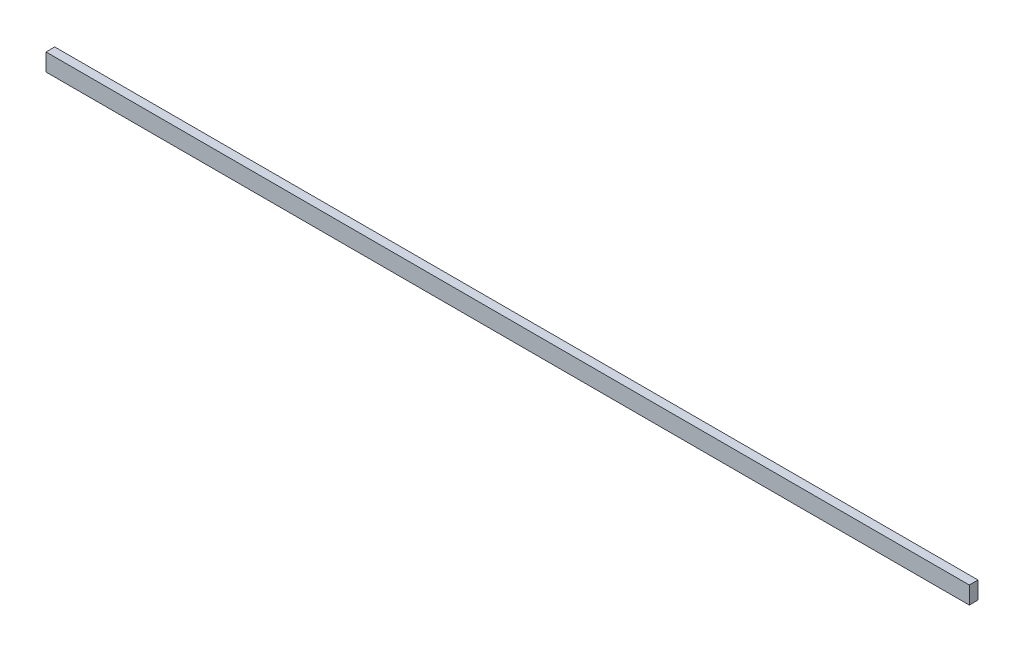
from build123d import *

# Parameters (mm, degrees)
ESQUISSE1_W      = 5
ESQUISSE1_H      = 10
EXTRUSION1_DEPTH = 530


with BuildPart() as part:
    # Esquisse1 → Extrusion1 (new body)
    with BuildSketch(Plane(origin=(0, 0, 0), x_dir=(0, 0, -1), z_dir=(1, 0, 0))):
        with Locations((2.5, 5)):
            Rectangle(ESQUISSE1_W, ESQUISSE1_H)
    extrude(amount=EXTRUSION1_DEPTH)


solid = part.part
